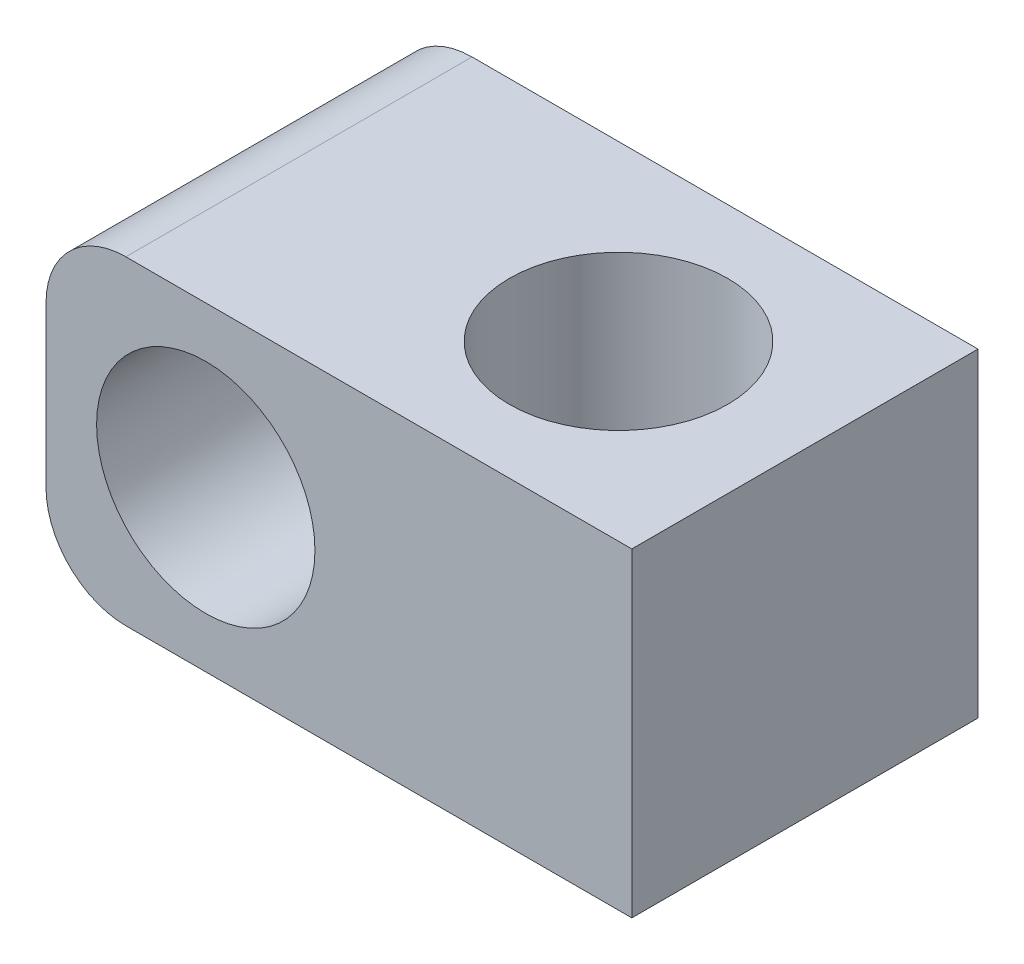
from build123d import *

# Parameters (mm, degrees)
BOSS_EXTRU_1_DEPTH      = 6.5
BOSS_EXTRU_1_DEPTH_BACK = 6.5
ESQUISSE1_W             = 22
ESQUISSE1_H             = 12
ESQUISSE1_R             = 4.1
ESQUISSE2_R             = 4.1
ENL_V_MAT_EXTRU_1_DEPTH = 12
CONG_1_R                = 3


with BuildPart() as part:
    # Esquisse1 → Boss.-Extru.1 (new, two sides: drawn at the far end of the back side and taken through both)
    with BuildSketch(Plane.XY.offset(-BOSS_EXTRU_1_DEPTH_BACK)):
        with Locations((5, 0)):
            Rectangle(ESQUISSE1_W, ESQUISSE1_H)
        Circle(ESQUISSE1_R, mode=Mode.SUBTRACT)
    extrude(amount=BOSS_EXTRU_1_DEPTH + BOSS_EXTRU_1_DEPTH_BACK)

    # Esquisse2 → Enl_v. mat.-Extru.1 (cut)
    with BuildSketch(Plane(origin=(0, 6, 0), x_dir=(1, 0, 0), z_dir=(0, 1, 0))):
        with Locations(Location((9, 0, 0), (0, 0, 270))):
            Circle(ESQUISSE2_R)
    extrude(amount=-ENL_V_MAT_EXTRU_1_DEPTH, mode=Mode.SUBTRACT)

    # Cong_1
    cong_1_edges = [part.edges().sort_by_distance(p)[0] for p in [
        (-6, -6, 0),
        (-6, 6, 0),
    ]]
    fillet(cong_1_edges, radius=CONG_1_R)


solid = part.part
